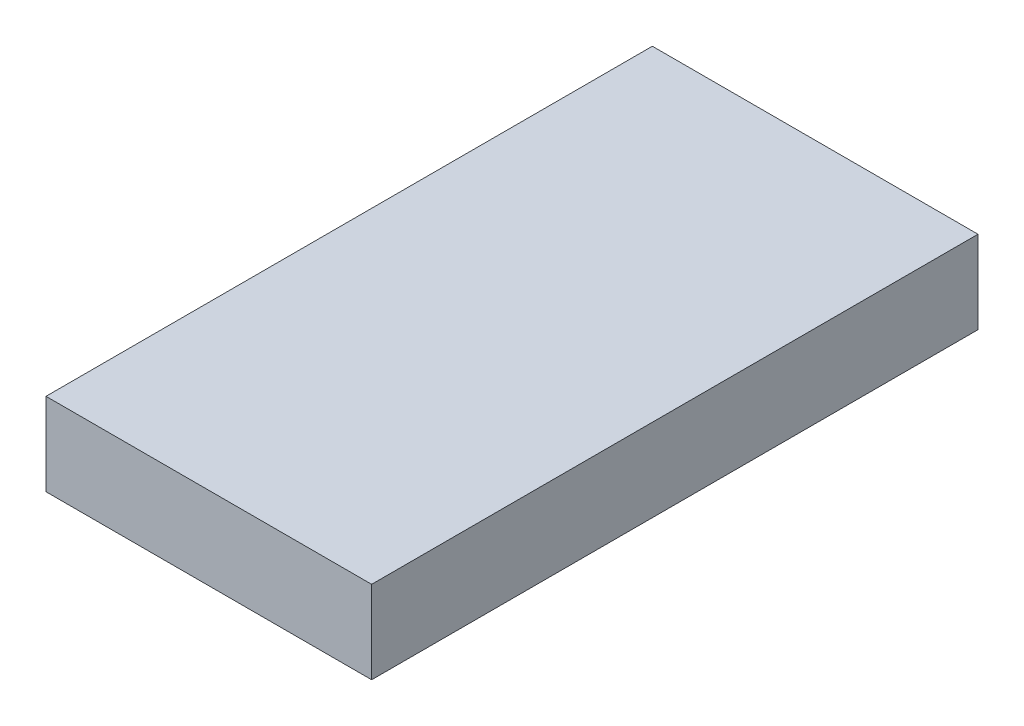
ISO-10303-21;
HEADER;
FILE_DESCRIPTION(('STEP AP214'),'2;1');
FILE_NAME('part.step','',(''),(''),'','','');
FILE_SCHEMA(('AUTOMOTIVE_DESIGN { 1 0 10303 214 1 1 1 1 }'));
ENDSEC;
DATA;
#1=APPLICATION_CONTEXT('core data for automotive mechanical design processes');
#2=APPLICATION_PROTOCOL_DEFINITION('international standard','automotive_design',2000,#1);
#3=PRODUCT_CONTEXT('',#1,'mechanical');
#4=PRODUCT('Part','Part','',(#3));
#5=PRODUCT_RELATED_PRODUCT_CATEGORY('part','',(#4));
#6=PRODUCT_DEFINITION_FORMATION('','',#4);
#7=PRODUCT_DEFINITION_CONTEXT('part definition',#1,'design');
#8=PRODUCT_DEFINITION('design','',#6,#7);
#9=PRODUCT_DEFINITION_SHAPE('','',#8);
#10=(LENGTH_UNIT() NAMED_UNIT(*) SI_UNIT(.MILLI.,.METRE.));
#11=(NAMED_UNIT(*) PLANE_ANGLE_UNIT() SI_UNIT($,.RADIAN.));
#12=(NAMED_UNIT(*) SI_UNIT($,.STERADIAN.) SOLID_ANGLE_UNIT());
#13=UNCERTAINTY_MEASURE_WITH_UNIT(LENGTH_MEASURE(1.E-05),#10,'distance_accuracy_value','');
#14=(GEOMETRIC_REPRESENTATION_CONTEXT(3) GLOBAL_UNCERTAINTY_ASSIGNED_CONTEXT((#13)) GLOBAL_UNIT_ASSIGNED_CONTEXT((#10,
#11,#12)) REPRESENTATION_CONTEXT('',''));
#15=CARTESIAN_POINT('',(0.,0.,0.));
#16=DIRECTION('',(0.,0.,1.));
#17=DIRECTION('',(1.,0.,0.));
#18=AXIS2_PLACEMENT_3D('',#15,#16,#17);
#19=CARTESIAN_POINT('',(0.,152.4,0.));
#20=DIRECTION('',(1.,0.,0.));
#21=DIRECTION('',(0.,0.,-1.));
#22=AXIS2_PLACEMENT_3D('',#19,#20,#21);
#23=PLANE('',#22);
#24=DIRECTION('',(0.,0.,1.));
#25=VECTOR('',#24,1.);
#26=CARTESIAN_POINT('',(0.,0.,0.));
#27=LINE('',#26,#25);
#28=CARTESIAN_POINT('',(0.,0.,-1117.6));
#29=VERTEX_POINT('',#28);
#30=CARTESIAN_POINT('',(0.,0.,0.));
#31=VERTEX_POINT('',#30);
#32=EDGE_CURVE('E97',#29,#31,#27,.T.);
#33=ORIENTED_EDGE('',*,*,#32,.T.);
#34=DIRECTION('',(0.,-1.,0.));
#35=VECTOR('',#34,1.);
#36=CARTESIAN_POINT('',(0.,152.4,0.));
#37=LINE('',#36,#35);
#38=CARTESIAN_POINT('',(0.,152.4,0.));
#39=VERTEX_POINT('',#38);
#40=EDGE_CURVE('E11',#39,#31,#37,.T.);
#41=ORIENTED_EDGE('',*,*,#40,.F.);
#42=DIRECTION('',(0.,0.,1.));
#43=VECTOR('',#42,1.);
#44=CARTESIAN_POINT('',(0.,152.4,0.));
#45=LINE('',#44,#43);
#46=CARTESIAN_POINT('',(0.,152.4,-1117.6));
#47=VERTEX_POINT('',#46);
#48=EDGE_CURVE('E85',#47,#39,#45,.T.);
#49=ORIENTED_EDGE('',*,*,#48,.F.);
#50=DIRECTION('',(0.,-1.,0.));
#51=VECTOR('',#50,1.);
#52=CARTESIAN_POINT('',(0.,152.4,-1117.6));
#53=LINE('',#52,#51);
#54=EDGE_CURVE('E93',#47,#29,#53,.T.);
#55=ORIENTED_EDGE('',*,*,#54,.T.);
#56=EDGE_LOOP('',(#33,#41,#49,#55));
#57=FACE_BOUND('',#56,.T.);
#58=ADVANCED_FACE('F34',(#57),#23,.F.);
#59=CARTESIAN_POINT('',(0.,152.4,0.));
#60=DIRECTION('',(0.,0.,-1.));
#61=DIRECTION('',(-1.,0.,0.));
#62=AXIS2_PLACEMENT_3D('',#59,#60,#61);
#63=PLANE('',#62);
#64=DIRECTION('',(1.,0.,0.));
#65=VECTOR('',#64,1.);
#66=CARTESIAN_POINT('',(0.,0.,0.));
#67=LINE('',#66,#65);
#68=CARTESIAN_POINT('',(600.2,0.,0.));
#69=VERTEX_POINT('',#68);
#70=EDGE_CURVE('E89',#31,#69,#67,.T.);
#71=ORIENTED_EDGE('',*,*,#70,.T.);
#72=DIRECTION('',(0.,-1.,0.));
#73=VECTOR('',#72,1.);
#74=CARTESIAN_POINT('',(600.2,152.4,0.));
#75=LINE('',#74,#73);
#76=CARTESIAN_POINT('',(600.2,152.4,0.));
#77=VERTEX_POINT('',#76);
#78=EDGE_CURVE('E42',#77,#69,#75,.T.);
#79=ORIENTED_EDGE('',*,*,#78,.F.);
#80=DIRECTION('',(1.,0.,0.));
#81=VECTOR('',#80,1.);
#82=CARTESIAN_POINT('',(0.,152.4,0.));
#83=LINE('',#82,#81);
#84=EDGE_CURVE('E80',#39,#77,#83,.T.);
#85=ORIENTED_EDGE('',*,*,#84,.F.);
#86=ORIENTED_EDGE('',*,*,#40,.T.);
#87=EDGE_LOOP('',(#71,#79,#85,#86));
#88=FACE_BOUND('',#87,.T.);
#89=ADVANCED_FACE('F88',(#88),#63,.F.);
#90=CARTESIAN_POINT('',(600.2,152.4,0.));
#91=DIRECTION('',(-1.,0.,0.));
#92=DIRECTION('',(0.,0.,1.));
#93=AXIS2_PLACEMENT_3D('',#90,#91,#92);
#94=PLANE('',#93);
#95=DIRECTION('',(0.,0.,-1.));
#96=VECTOR('',#95,1.);
#97=CARTESIAN_POINT('',(600.2,0.,0.));
#98=LINE('',#97,#96);
#99=CARTESIAN_POINT('',(600.2,0.,-1117.6));
#100=VERTEX_POINT('',#99);
#101=EDGE_CURVE('E67',#69,#100,#98,.T.);
#102=ORIENTED_EDGE('',*,*,#101,.T.);
#103=DIRECTION('',(0.,-1.,0.));
#104=VECTOR('',#103,1.);
#105=CARTESIAN_POINT('',(600.2,152.4,-1117.6));
#106=LINE('',#105,#104);
#107=CARTESIAN_POINT('',(600.2,152.4,-1117.6));
#108=VERTEX_POINT('',#107);
#109=EDGE_CURVE('E90',#108,#100,#106,.T.);
#110=ORIENTED_EDGE('',*,*,#109,.F.);
#111=DIRECTION('',(0.,0.,-1.));
#112=VECTOR('',#111,1.);
#113=CARTESIAN_POINT('',(600.2,152.4,0.));
#114=LINE('',#113,#112);
#115=EDGE_CURVE('E83',#77,#108,#114,.T.);
#116=ORIENTED_EDGE('',*,*,#115,.F.);
#117=ORIENTED_EDGE('',*,*,#78,.T.);
#118=EDGE_LOOP('',(#102,#110,#116,#117));
#119=FACE_BOUND('',#118,.T.);
#120=ADVANCED_FACE('F91',(#119),#94,.F.);
#121=CARTESIAN_POINT('',(0.,152.4,-1117.6));
#122=DIRECTION('',(0.,0.,1.));
#123=DIRECTION('',(1.,0.,0.));
#124=AXIS2_PLACEMENT_3D('',#121,#122,#123);
#125=PLANE('',#124);
#126=DIRECTION('',(-1.,0.,0.));
#127=VECTOR('',#126,1.);
#128=CARTESIAN_POINT('',(0.,0.,-1117.6));
#129=LINE('',#128,#127);
#130=EDGE_CURVE('E73',#100,#29,#129,.T.);
#131=ORIENTED_EDGE('',*,*,#130,.T.);
#132=ORIENTED_EDGE('',*,*,#54,.F.);
#133=DIRECTION('',(-1.,0.,0.));
#134=VECTOR('',#133,1.);
#135=CARTESIAN_POINT('',(0.,152.4,-1117.6));
#136=LINE('',#135,#134);
#137=EDGE_CURVE('E50',#108,#47,#136,.T.);
#138=ORIENTED_EDGE('',*,*,#137,.F.);
#139=ORIENTED_EDGE('',*,*,#109,.T.);
#140=EDGE_LOOP('',(#131,#132,#138,#139));
#141=FACE_BOUND('',#140,.T.);
#142=ADVANCED_FACE('F104',(#141),#125,.F.);
#143=CARTESIAN_POINT('',(0.,152.4,-1117.6));
#144=DIRECTION('',(0.,-1.,0.));
#145=DIRECTION('',(0.,0.,-1.));
#146=AXIS2_PLACEMENT_3D('',#143,#144,#145);
#147=PLANE('',#146);
#148=ORIENTED_EDGE('',*,*,#48,.T.);
#149=ORIENTED_EDGE('',*,*,#84,.T.);
#150=ORIENTED_EDGE('',*,*,#115,.T.);
#151=ORIENTED_EDGE('',*,*,#137,.T.);
#152=EDGE_LOOP('',(#148,#149,#150,#151));
#153=FACE_BOUND('',#152,.T.);
#154=ADVANCED_FACE('F81',(#153),#147,.F.);
#155=CARTESIAN_POINT('',(0.,0.,-1117.6));
#156=DIRECTION('',(0.,-1.,0.));
#157=DIRECTION('',(0.,0.,-1.));
#158=AXIS2_PLACEMENT_3D('',#155,#156,#157);
#159=PLANE('',#158);
#160=ORIENTED_EDGE('',*,*,#32,.F.);
#161=ORIENTED_EDGE('',*,*,#130,.F.);
#162=ORIENTED_EDGE('',*,*,#101,.F.);
#163=ORIENTED_EDGE('',*,*,#70,.F.);
#164=EDGE_LOOP('',(#160,#161,#162,#163));
#165=FACE_BOUND('',#164,.T.);
#166=ADVANCED_FACE('F107',(#165),#159,.T.);
#167=CLOSED_SHELL('',(#58,#89,#120,#142,#154,#166));
#168=MANIFOLD_SOLID_BREP('B2',#167);
#169=ADVANCED_BREP_SHAPE_REPRESENTATION('',(#18,#168),#14);
#170=SHAPE_DEFINITION_REPRESENTATION(#9,#169);
ENDSEC;
END-ISO-10303-21;
